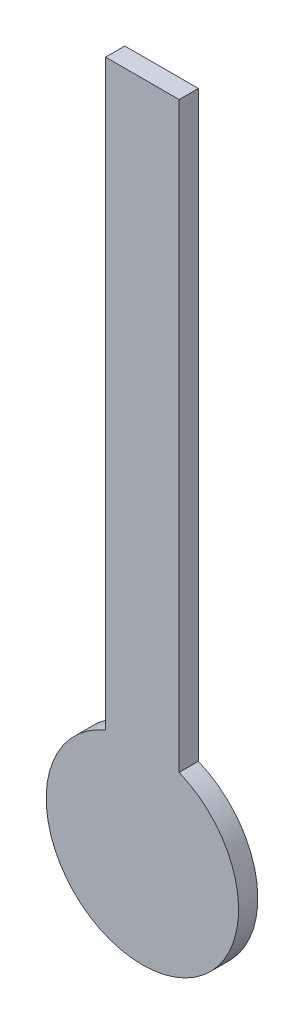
ISO-10303-21;
HEADER;
FILE_DESCRIPTION(('STEP AP214'),'2;1');
FILE_NAME('part.step','',(''),(''),'','','');
FILE_SCHEMA(('AUTOMOTIVE_DESIGN { 1 0 10303 214 1 1 1 1 }'));
ENDSEC;
DATA;
#1=APPLICATION_CONTEXT('core data for automotive mechanical design processes');
#2=APPLICATION_PROTOCOL_DEFINITION('international standard','automotive_design',2000,#1);
#3=PRODUCT_CONTEXT('',#1,'mechanical');
#4=PRODUCT('Part','Part','',(#3));
#5=PRODUCT_RELATED_PRODUCT_CATEGORY('part','',(#4));
#6=PRODUCT_DEFINITION_FORMATION('','',#4);
#7=PRODUCT_DEFINITION_CONTEXT('part definition',#1,'design');
#8=PRODUCT_DEFINITION('design','',#6,#7);
#9=PRODUCT_DEFINITION_SHAPE('','',#8);
#10=(LENGTH_UNIT() NAMED_UNIT(*) SI_UNIT(.MILLI.,.METRE.));
#11=(NAMED_UNIT(*) PLANE_ANGLE_UNIT() SI_UNIT($,.RADIAN.));
#12=(NAMED_UNIT(*) SI_UNIT($,.STERADIAN.) SOLID_ANGLE_UNIT());
#13=UNCERTAINTY_MEASURE_WITH_UNIT(LENGTH_MEASURE(1.E-05),#10,'distance_accuracy_value','');
#14=(GEOMETRIC_REPRESENTATION_CONTEXT(3) GLOBAL_UNCERTAINTY_ASSIGNED_CONTEXT((#13)) GLOBAL_UNIT_ASSIGNED_CONTEXT((#10,
#11,#12)) REPRESENTATION_CONTEXT('',''));
#15=CARTESIAN_POINT('',(0.,0.,0.));
#16=DIRECTION('',(0.,0.,1.));
#17=DIRECTION('',(1.,0.,0.));
#18=AXIS2_PLACEMENT_3D('',#15,#16,#17);
#19=CARTESIAN_POINT('',(1.90951980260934,4.62101007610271,1.));
#20=DIRECTION('',(-1.,0.,0.));
#21=DIRECTION('',(0.,0.,1.));
#22=AXIS2_PLACEMENT_3D('',#19,#20,#21);
#23=PLANE('',#22);
#24=DIRECTION('',(0.,1.,0.));
#25=VECTOR('',#24,1.);
#26=CARTESIAN_POINT('',(1.90951980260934,4.62101007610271,0.));
#27=LINE('',#26,#25);
#28=CARTESIAN_POINT('',(1.90951980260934,4.62101007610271,0.));
#29=VERTEX_POINT('',#28);
#30=CARTESIAN_POINT('',(1.90951980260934,34.9148472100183,0.));
#31=VERTEX_POINT('',#30);
#32=EDGE_CURVE('E96',#29,#31,#27,.T.);
#33=ORIENTED_EDGE('',*,*,#32,.T.);
#34=DIRECTION('',(0.,0.,-1.));
#35=VECTOR('',#34,1.);
#36=CARTESIAN_POINT('',(1.90951980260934,34.9148472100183,1.));
#37=LINE('',#36,#35);
#38=CARTESIAN_POINT('',(1.90951980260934,34.9148472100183,1.));
#39=VERTEX_POINT('',#38);
#40=EDGE_CURVE('E11',#39,#31,#37,.T.);
#41=ORIENTED_EDGE('',*,*,#40,.F.);
#42=DIRECTION('',(0.,1.,0.));
#43=VECTOR('',#42,1.);
#44=CARTESIAN_POINT('',(1.90951980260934,4.62101007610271,1.));
#45=LINE('',#44,#43);
#46=CARTESIAN_POINT('',(1.90951980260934,4.62101007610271,1.));
#47=VERTEX_POINT('',#46);
#48=EDGE_CURVE('E84',#47,#39,#45,.T.);
#49=ORIENTED_EDGE('',*,*,#48,.F.);
#50=DIRECTION('',(0.,0.,-1.));
#51=VECTOR('',#50,1.);
#52=CARTESIAN_POINT('',(1.90951980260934,4.62101007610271,1.));
#53=LINE('',#52,#51);
#54=EDGE_CURVE('E92',#47,#29,#53,.T.);
#55=ORIENTED_EDGE('',*,*,#54,.T.);
#56=EDGE_LOOP('',(#33,#41,#49,#55));
#57=FACE_BOUND('',#56,.T.);
#58=ADVANCED_FACE('F33',(#57),#23,.F.);
#59=CARTESIAN_POINT('',(-1.91230976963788,34.9148472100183,1.));
#60=DIRECTION('',(0.,-1.,0.));
#61=DIRECTION('',(0.,0.,-1.));
#62=AXIS2_PLACEMENT_3D('',#59,#60,#61);
#63=PLANE('',#62);
#64=DIRECTION('',(-1.,0.,0.));
#65=VECTOR('',#64,1.);
#66=CARTESIAN_POINT('',(-1.91230976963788,34.9148472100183,0.));
#67=LINE('',#66,#65);
#68=CARTESIAN_POINT('',(-1.91230976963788,34.9148472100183,0.));
#69=VERTEX_POINT('',#68);
#70=EDGE_CURVE('E88',#31,#69,#67,.T.);
#71=ORIENTED_EDGE('',*,*,#70,.T.);
#72=DIRECTION('',(0.,0.,-1.));
#73=VECTOR('',#72,1.);
#74=CARTESIAN_POINT('',(-1.91230976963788,34.9148472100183,1.));
#75=LINE('',#74,#73);
#76=CARTESIAN_POINT('',(-1.91230976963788,34.9148472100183,1.));
#77=VERTEX_POINT('',#76);
#78=EDGE_CURVE('E41',#77,#69,#75,.T.);
#79=ORIENTED_EDGE('',*,*,#78,.F.);
#80=DIRECTION('',(-1.,0.,0.));
#81=VECTOR('',#80,1.);
#82=CARTESIAN_POINT('',(-1.91230976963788,34.9148472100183,1.));
#83=LINE('',#82,#81);
#84=EDGE_CURVE('E79',#39,#77,#83,.T.);
#85=ORIENTED_EDGE('',*,*,#84,.F.);
#86=ORIENTED_EDGE('',*,*,#40,.T.);
#87=EDGE_LOOP('',(#71,#79,#85,#86));
#88=FACE_BOUND('',#87,.T.);
#89=ADVANCED_FACE('F87',(#88),#63,.F.);
#90=CARTESIAN_POINT('',(-1.91230976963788,4.61985620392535,1.));
#91=DIRECTION('',(1.,0.,0.));
#92=DIRECTION('',(0.,0.,-1.));
#93=AXIS2_PLACEMENT_3D('',#90,#91,#92);
#94=PLANE('',#93);
#95=DIRECTION('',(0.,-1.,0.));
#96=VECTOR('',#95,1.);
#97=CARTESIAN_POINT('',(-1.91230976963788,4.61985620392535,0.));
#98=LINE('',#97,#96);
#99=CARTESIAN_POINT('',(-1.91230976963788,4.61985620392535,0.));
#100=VERTEX_POINT('',#99);
#101=EDGE_CURVE('E66',#69,#100,#98,.T.);
#102=ORIENTED_EDGE('',*,*,#101,.T.);
#103=DIRECTION('',(0.,0.,-1.));
#104=VECTOR('',#103,1.);
#105=CARTESIAN_POINT('',(-1.91230976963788,4.61985620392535,1.));
#106=LINE('',#105,#104);
#107=CARTESIAN_POINT('',(-1.91230976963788,4.61985620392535,1.));
#108=VERTEX_POINT('',#107);
#109=EDGE_CURVE('E89',#108,#100,#106,.T.);
#110=ORIENTED_EDGE('',*,*,#109,.F.);
#111=DIRECTION('',(0.,-1.,0.));
#112=VECTOR('',#111,1.);
#113=CARTESIAN_POINT('',(-1.91230976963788,4.61985620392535,1.));
#114=LINE('',#113,#112);
#115=EDGE_CURVE('E82',#77,#108,#114,.T.);
#116=ORIENTED_EDGE('',*,*,#115,.F.);
#117=ORIENTED_EDGE('',*,*,#78,.T.);
#118=EDGE_LOOP('',(#102,#110,#116,#117));
#119=FACE_BOUND('',#118,.T.);
#120=ADVANCED_FACE('F90',(#119),#94,.F.);
#121=CARTESIAN_POINT('',(0.,0.,1.));
#122=DIRECTION('',(0.,0.,-1.));
#123=DIRECTION('',(-1.,0.,0.));
#124=AXIS2_PLACEMENT_3D('',#121,#122,#123);
#125=CYLINDRICAL_SURFACE('',#124,5.);
#126=CARTESIAN_POINT('',(0.,0.,0.));
#127=DIRECTION('',(0.,0.,1.));
#128=DIRECTION('',(1.,0.,0.));
#129=AXIS2_PLACEMENT_3D('',#126,#127,#128);
#130=CIRCLE('',#129,5.);
#131=EDGE_CURVE('E72',#100,#29,#130,.T.);
#132=ORIENTED_EDGE('',*,*,#131,.T.);
#133=ORIENTED_EDGE('',*,*,#54,.F.);
#134=CARTESIAN_POINT('',(0.,0.,1.));
#135=DIRECTION('',(0.,0.,1.));
#136=DIRECTION('',(1.,0.,0.));
#137=AXIS2_PLACEMENT_3D('',#134,#135,#136);
#138=CIRCLE('',#137,5.);
#139=EDGE_CURVE('E49',#108,#47,#138,.T.);
#140=ORIENTED_EDGE('',*,*,#139,.F.);
#141=ORIENTED_EDGE('',*,*,#109,.T.);
#142=EDGE_LOOP('',(#132,#133,#140,#141));
#143=FACE_BOUND('',#142,.T.);
#144=ADVANCED_FACE('F103',(#143),#125,.T.);
#145=CARTESIAN_POINT('',(0.,0.,1.));
#146=DIRECTION('',(0.,0.,1.));
#147=DIRECTION('',(1.,0.,0.));
#148=AXIS2_PLACEMENT_3D('',#145,#146,#147);
#149=PLANE('',#148);
#150=ORIENTED_EDGE('',*,*,#48,.T.);
#151=ORIENTED_EDGE('',*,*,#84,.T.);
#152=ORIENTED_EDGE('',*,*,#115,.T.);
#153=ORIENTED_EDGE('',*,*,#139,.T.);
#154=EDGE_LOOP('',(#150,#151,#152,#153));
#155=FACE_BOUND('',#154,.T.);
#156=ADVANCED_FACE('F80',(#155),#149,.T.);
#157=CARTESIAN_POINT('',(0.,0.,0.));
#158=DIRECTION('',(0.,0.,1.));
#159=DIRECTION('',(1.,0.,0.));
#160=AXIS2_PLACEMENT_3D('',#157,#158,#159);
#161=PLANE('',#160);
#162=ORIENTED_EDGE('',*,*,#32,.F.);
#163=ORIENTED_EDGE('',*,*,#131,.F.);
#164=ORIENTED_EDGE('',*,*,#101,.F.);
#165=ORIENTED_EDGE('',*,*,#70,.F.);
#166=EDGE_LOOP('',(#162,#163,#164,#165));
#167=FACE_BOUND('',#166,.T.);
#168=ADVANCED_FACE('F106',(#167),#161,.F.);
#169=CLOSED_SHELL('',(#58,#89,#120,#144,#156,#168));
#170=MANIFOLD_SOLID_BREP('B2',#169);
#171=ADVANCED_BREP_SHAPE_REPRESENTATION('',(#18,#170),#14);
#172=SHAPE_DEFINITION_REPRESENTATION(#9,#171);
ENDSEC;
END-ISO-10303-21;
